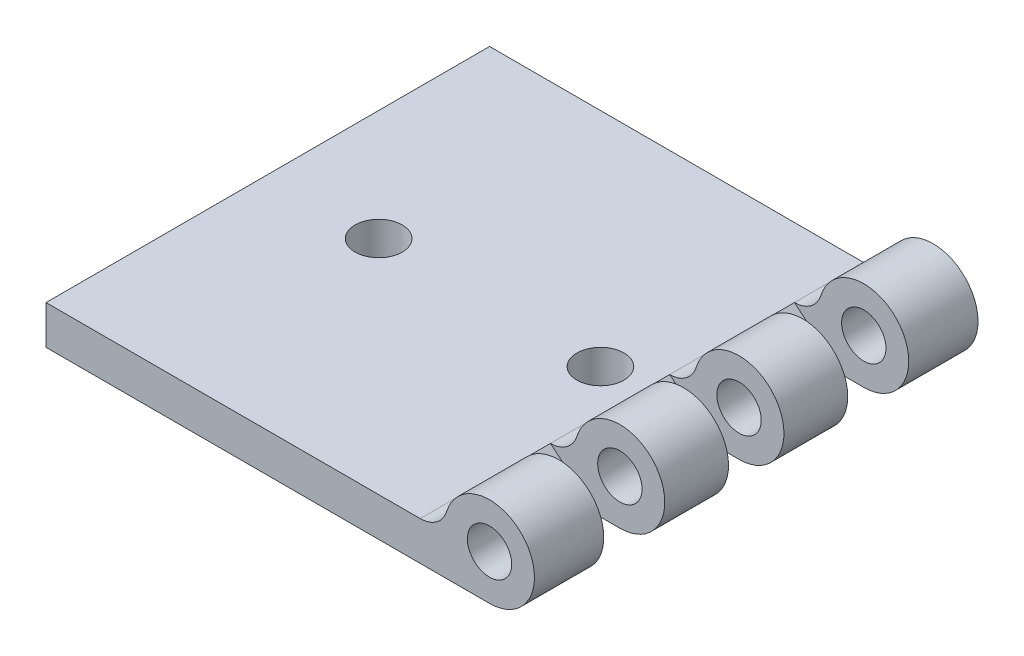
ISO-10303-21;
HEADER;
FILE_DESCRIPTION(('STEP AP214'),'2;1');
FILE_NAME('part.step','',(''),(''),'','','');
FILE_SCHEMA(('AUTOMOTIVE_DESIGN { 1 0 10303 214 1 1 1 1 }'));
ENDSEC;
DATA;
#1=APPLICATION_CONTEXT('core data for automotive mechanical design processes');
#2=APPLICATION_PROTOCOL_DEFINITION('international standard','automotive_design',2000,#1);
#3=PRODUCT_CONTEXT('',#1,'mechanical');
#4=PRODUCT('Part','Part','',(#3));
#5=PRODUCT_RELATED_PRODUCT_CATEGORY('part','',(#4));
#6=PRODUCT_DEFINITION_FORMATION('','',#4);
#7=PRODUCT_DEFINITION_CONTEXT('part definition',#1,'design');
#8=PRODUCT_DEFINITION('design','',#6,#7);
#9=PRODUCT_DEFINITION_SHAPE('','',#8);
#10=(LENGTH_UNIT() NAMED_UNIT(*) SI_UNIT(.MILLI.,.METRE.));
#11=(NAMED_UNIT(*) PLANE_ANGLE_UNIT() SI_UNIT($,.RADIAN.));
#12=(NAMED_UNIT(*) SI_UNIT($,.STERADIAN.) SOLID_ANGLE_UNIT());
#13=UNCERTAINTY_MEASURE_WITH_UNIT(LENGTH_MEASURE(1.E-05),#10,'distance_accuracy_value','');
#14=(GEOMETRIC_REPRESENTATION_CONTEXT(3) GLOBAL_UNCERTAINTY_ASSIGNED_CONTEXT((#13)) GLOBAL_UNIT_ASSIGNED_CONTEXT((#10,
#11,#12)) REPRESENTATION_CONTEXT('',''));
#15=CARTESIAN_POINT('',(0.,0.,0.));
#16=DIRECTION('',(0.,0.,1.));
#17=DIRECTION('',(1.,0.,0.));
#18=AXIS2_PLACEMENT_3D('',#15,#16,#17);
#19=CARTESIAN_POINT('',(-12.5059985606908,12.,80.));
#20=DIRECTION('',(0.,0.,-1.));
#21=DIRECTION('',(-1.,0.,0.));
#22=AXIS2_PLACEMENT_3D('',#19,#20,#21);
#23=CYLINDRICAL_SURFACE('',#22,5.);
#24=CARTESIAN_POINT('',(-12.5059985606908,12.,23.5));
#25=DIRECTION('',(0.,0.,-1.));
#26=DIRECTION('',(0.,1.,0.));
#27=AXIS2_PLACEMENT_3D('',#24,#25,#26);
#28=CIRCLE('',#27,5.);
#29=CARTESIAN_POINT('',(-12.5059985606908,6.99999999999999,23.5));
#30=VERTEX_POINT('',#29);
#31=CARTESIAN_POINT('',(-7.73271666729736,10.5114503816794,23.5));
#32=VERTEX_POINT('',#31);
#33=EDGE_CURVE('E158',#30,#32,#28,.F.);
#34=ORIENTED_EDGE('',*,*,#33,.F.);
#35=DIRECTION('',(0.,0.,-1.));
#36=VECTOR('',#35,1.);
#37=CARTESIAN_POINT('',(-12.5059985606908,6.99999999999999,80.));
#38=LINE('',#37,#36);
#39=CARTESIAN_POINT('',(-12.5059985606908,6.99999999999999,35.));
#40=VERTEX_POINT('',#39);
#41=EDGE_CURVE('E176',#40,#30,#38,.T.);
#42=ORIENTED_EDGE('',*,*,#41,.F.);
#43=CARTESIAN_POINT('',(-12.5059985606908,12.,35.));
#44=DIRECTION('',(0.,0.,1.));
#45=DIRECTION('',(1.,0.,0.));
#46=AXIS2_PLACEMENT_3D('',#43,#44,#45);
#47=CIRCLE('',#46,5.);
#48=CARTESIAN_POINT('',(-7.73271666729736,10.5114503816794,35.));
#49=VERTEX_POINT('',#48);
#50=EDGE_CURVE('E210',#49,#40,#47,.F.);
#51=ORIENTED_EDGE('',*,*,#50,.F.);
#52=DIRECTION('',(0.,0.,-1.));
#53=VECTOR('',#52,1.);
#54=CARTESIAN_POINT('',(-7.73271666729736,10.5114503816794,80.));
#55=LINE('',#54,#53);
#56=EDGE_CURVE('E179',#49,#32,#55,.T.);
#57=ORIENTED_EDGE('',*,*,#56,.T.);
#58=EDGE_LOOP('',(#34,#42,#51,#57));
#59=FACE_BOUND('',#58,.T.);
#60=ADVANCED_FACE('F34',(#59),#23,.F.);
#61=CARTESIAN_POINT('',(-12.5059985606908,12.,12.5));
#62=DIRECTION('',(0.,0.,1.));
#63=DIRECTION('',(0.,-1.,0.));
#64=AXIS2_PLACEMENT_3D('',#61,#62,#63);
#65=CIRCLE('',#64,5.);
#66=CARTESIAN_POINT('',(-7.73271666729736,10.5114503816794,12.5));
#67=VERTEX_POINT('',#66);
#68=CARTESIAN_POINT('',(-12.5059985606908,6.99999999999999,12.5));
#69=VERTEX_POINT('',#68);
#70=EDGE_CURVE('E222',#67,#69,#65,.F.);
#71=ORIENTED_EDGE('',*,*,#70,.F.);
#72=CARTESIAN_POINT('',(-7.73271666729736,10.5114503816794,0.));
#73=VERTEX_POINT('',#72);
#74=EDGE_CURVE('E276',#67,#73,#55,.T.);
#75=ORIENTED_EDGE('',*,*,#74,.T.);
#76=CARTESIAN_POINT('',(-12.5059985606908,12.,0.));
#77=DIRECTION('',(0.,0.,-1.));
#78=DIRECTION('',(-1.,0.,0.));
#79=AXIS2_PLACEMENT_3D('',#76,#77,#78);
#80=CIRCLE('',#79,5.);
#81=CARTESIAN_POINT('',(-12.5059985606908,6.99999999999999,0.));
#82=VERTEX_POINT('',#81);
#83=EDGE_CURVE('E261',#73,#82,#80,.T.);
#84=ORIENTED_EDGE('',*,*,#83,.T.);
#85=EDGE_CURVE('E185',#69,#82,#38,.T.);
#86=ORIENTED_EDGE('',*,*,#85,.F.);
#87=EDGE_LOOP('',(#71,#75,#84,#86));
#88=FACE_BOUND('',#87,.T.);
#89=ADVANCED_FACE('F369',(#88),#23,.F.);
#90=CARTESIAN_POINT('',(0.,0.,80.));
#91=DIRECTION('',(0.,1.,0.));
#92=DIRECTION('',(-1.,0.,0.));
#93=AXIS2_PLACEMENT_3D('',#90,#91,#92);
#94=PLANE('',#93);
#95=CARTESIAN_POINT('',(-20.,0.,40.));
#96=DIRECTION('',(0.,1.,0.));
#97=DIRECTION('',(-1.,0.,0.));
#98=AXIS2_PLACEMENT_3D('',#95,#96,#97);
#99=CIRCLE('',#98,4.25);
#100=CARTESIAN_POINT('',(-24.25,0.,40.));
#101=VERTEX_POINT('',#100);
#102=EDGE_CURVE('E432',#101,#101,#99,.T.);
#103=ORIENTED_EDGE('',*,*,#102,.T.);
#104=EDGE_LOOP('',(#103));
#105=FACE_BOUND('',#104,.T.);
#106=CARTESIAN_POINT('',(-60.,0.,40.));
#107=DIRECTION('',(0.,1.,0.));
#108=DIRECTION('',(-1.,0.,0.));
#109=AXIS2_PLACEMENT_3D('',#106,#107,#108);
#110=CIRCLE('',#109,4.25000000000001);
#111=CARTESIAN_POINT('',(-64.25,0.,40.));
#112=VERTEX_POINT('',#111);
#113=EDGE_CURVE('E170',#112,#112,#110,.T.);
#114=ORIENTED_EDGE('',*,*,#113,.T.);
#115=EDGE_LOOP('',(#114));
#116=FACE_BOUND('',#115,.T.);
#117=DIRECTION('',(-1.,0.,0.));
#118=VECTOR('',#117,1.);
#119=CARTESIAN_POINT('',(0.,0.,23.5));
#120=LINE('',#119,#118);
#121=CARTESIAN_POINT('',(0.,0.,23.5));
#122=VERTEX_POINT('',#121);
#123=CARTESIAN_POINT('',(-4.16372341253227,0.,23.5));
#124=VERTEX_POINT('',#123);
#125=EDGE_CURVE('E161',#122,#124,#120,.T.);
#126=ORIENTED_EDGE('',*,*,#125,.F.);
#127=DIRECTION('',(0.,0.,-1.));
#128=VECTOR('',#127,1.);
#129=CARTESIAN_POINT('',(0.,0.,80.));
#130=LINE('',#129,#128);
#131=CARTESIAN_POINT('',(0.,0.,35.));
#132=VERTEX_POINT('',#131);
#133=EDGE_CURVE('E319',#132,#122,#130,.T.);
#134=ORIENTED_EDGE('',*,*,#133,.F.);
#135=DIRECTION('',(1.,0.,0.));
#136=VECTOR('',#135,1.);
#137=CARTESIAN_POINT('',(0.,0.,35.));
#138=LINE('',#137,#136);
#139=CARTESIAN_POINT('',(-4.16372341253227,0.,35.));
#140=VERTEX_POINT('',#139);
#141=EDGE_CURVE('E233',#140,#132,#138,.T.);
#142=ORIENTED_EDGE('',*,*,#141,.F.);
#143=DIRECTION('',(0.,0.,-1.));
#144=VECTOR('',#143,1.);
#145=CARTESIAN_POINT('',(-4.16372341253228,0.,80.));
#146=LINE('',#145,#144);
#147=CARTESIAN_POINT('',(-4.16372341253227,0.,45.));
#148=VERTEX_POINT('',#147);
#149=EDGE_CURVE('E206',#148,#140,#146,.T.);
#150=ORIENTED_EDGE('',*,*,#149,.F.);
#151=DIRECTION('',(-1.,0.,0.));
#152=VECTOR('',#151,1.);
#153=CARTESIAN_POINT('',(0.,0.,45.));
#154=LINE('',#153,#152);
#155=CARTESIAN_POINT('',(0.,0.,45.));
#156=VERTEX_POINT('',#155);
#157=EDGE_CURVE('E237',#156,#148,#154,.T.);
#158=ORIENTED_EDGE('',*,*,#157,.F.);
#159=CARTESIAN_POINT('',(0.,0.,56.5));
#160=VERTEX_POINT('',#159);
#161=EDGE_CURVE('E296',#160,#156,#130,.T.);
#162=ORIENTED_EDGE('',*,*,#161,.F.);
#163=DIRECTION('',(1.,0.,0.));
#164=VECTOR('',#163,1.);
#165=CARTESIAN_POINT('',(0.,0.,56.5));
#166=LINE('',#165,#164);
#167=CARTESIAN_POINT('',(-4.16372341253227,0.,56.5));
#168=VERTEX_POINT('',#167);
#169=EDGE_CURVE('E249',#168,#160,#166,.T.);
#170=ORIENTED_EDGE('',*,*,#169,.F.);
#171=DIRECTION('',(0.,0.,-1.));
#172=VECTOR('',#171,1.);
#173=CARTESIAN_POINT('',(-4.16372341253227,0.,80.));
#174=LINE('',#173,#172);
#175=CARTESIAN_POINT('',(-4.16372341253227,0.,67.5));
#176=VERTEX_POINT('',#175);
#177=EDGE_CURVE('E11',#176,#168,#174,.T.);
#178=ORIENTED_EDGE('',*,*,#177,.F.);
#179=DIRECTION('',(-1.,0.,0.));
#180=VECTOR('',#179,1.);
#181=CARTESIAN_POINT('',(0.,0.,67.5));
#182=LINE('',#181,#180);
#183=CARTESIAN_POINT('',(0.,0.,67.5));
#184=VERTEX_POINT('',#183);
#185=EDGE_CURVE('E253',#184,#176,#182,.T.);
#186=ORIENTED_EDGE('',*,*,#185,.F.);
#187=CARTESIAN_POINT('',(0.,0.,80.));
#188=VERTEX_POINT('',#187);
#189=EDGE_CURVE('E293',#188,#184,#130,.T.);
#190=ORIENTED_EDGE('',*,*,#189,.F.);
#191=DIRECTION('',(1.,0.,0.));
#192=VECTOR('',#191,1.);
#193=CARTESIAN_POINT('',(0.,0.,80.));
#194=LINE('',#193,#192);
#195=CARTESIAN_POINT('',(-80.,0.,80.));
#196=VERTEX_POINT('',#195);
#197=EDGE_CURVE('E272',#196,#188,#194,.T.);
#198=ORIENTED_EDGE('',*,*,#197,.F.);
#199=DIRECTION('',(0.,0.,-1.));
#200=VECTOR('',#199,1.);
#201=CARTESIAN_POINT('',(-80.,0.,80.));
#202=LINE('',#201,#200);
#203=CARTESIAN_POINT('',(-80.,0.,0.));
#204=VERTEX_POINT('',#203);
#205=EDGE_CURVE('E295',#196,#204,#202,.T.);
#206=ORIENTED_EDGE('',*,*,#205,.T.);
#207=DIRECTION('',(1.,0.,0.));
#208=VECTOR('',#207,1.);
#209=CARTESIAN_POINT('',(0.,0.,0.));
#210=LINE('',#209,#208);
#211=CARTESIAN_POINT('',(0.,0.,0.));
#212=VERTEX_POINT('',#211);
#213=EDGE_CURVE('E283',#204,#212,#210,.T.);
#214=ORIENTED_EDGE('',*,*,#213,.T.);
#215=CARTESIAN_POINT('',(0.,0.,12.5));
#216=VERTEX_POINT('',#215);
#217=EDGE_CURVE('E291',#216,#212,#130,.T.);
#218=ORIENTED_EDGE('',*,*,#217,.F.);
#219=DIRECTION('',(1.,0.,0.));
#220=VECTOR('',#219,1.);
#221=CARTESIAN_POINT('',(0.,0.,12.5));
#222=LINE('',#221,#220);
#223=CARTESIAN_POINT('',(-4.16372341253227,0.,12.5));
#224=VERTEX_POINT('',#223);
#225=EDGE_CURVE('E216',#224,#216,#222,.T.);
#226=ORIENTED_EDGE('',*,*,#225,.F.);
#227=DIRECTION('',(0.,0.,-1.));
#228=VECTOR('',#227,1.);
#229=CARTESIAN_POINT('',(-4.16372341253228,0.,80.));
#230=LINE('',#229,#228);
#231=EDGE_CURVE('E163',#124,#224,#230,.T.);
#232=ORIENTED_EDGE('',*,*,#231,.F.);
#233=EDGE_LOOP('',(#126,#134,#142,#150,#158,#162,#170,#178,#186,#190,#198,#206,#214,#218,#226,#232));
#234=FACE_BOUND('',#233,.T.);
#235=ADVANCED_FACE('F315',(#105,#116,#234),#94,.F.);
#236=CARTESIAN_POINT('',(0.,8.1,80.));
#237=DIRECTION('',(0.,0.,-1.));
#238=DIRECTION('',(-1.,0.,0.));
#239=AXIS2_PLACEMENT_3D('',#236,#237,#238);
#240=CYLINDRICAL_SURFACE('',#239,8.1);
#241=CARTESIAN_POINT('',(0.,8.1,23.5));
#242=DIRECTION('',(0.,0.,-1.));
#243=DIRECTION('',(0.,1.,0.));
#244=AXIS2_PLACEMENT_3D('',#241,#242,#243);
#245=CIRCLE('',#244,8.1);
#246=EDGE_CURVE('E224',#32,#122,#245,.T.);
#247=ORIENTED_EDGE('',*,*,#246,.F.);
#248=ORIENTED_EDGE('',*,*,#56,.F.);
#249=CARTESIAN_POINT('',(0.,8.1,35.));
#250=DIRECTION('',(0.,0.,1.));
#251=DIRECTION('',(1.,0.,0.));
#252=AXIS2_PLACEMENT_3D('',#249,#250,#251);
#253=CIRCLE('',#252,8.1);
#254=EDGE_CURVE('E205',#132,#49,#253,.T.);
#255=ORIENTED_EDGE('',*,*,#254,.F.);
#256=ORIENTED_EDGE('',*,*,#133,.T.);
#257=EDGE_LOOP('',(#247,#248,#255,#256));
#258=FACE_BOUND('',#257,.T.);
#259=ADVANCED_FACE('F374',(#258),#240,.T.);
#260=CARTESIAN_POINT('',(0.,8.1,12.5));
#261=DIRECTION('',(0.,0.,1.));
#262=DIRECTION('',(0.,-1.,0.));
#263=AXIS2_PLACEMENT_3D('',#260,#261,#262);
#264=CIRCLE('',#263,8.1);
#265=EDGE_CURVE('E213',#216,#67,#264,.T.);
#266=ORIENTED_EDGE('',*,*,#265,.F.);
#267=ORIENTED_EDGE('',*,*,#217,.T.);
#268=CARTESIAN_POINT('',(0.,8.1,0.));
#269=DIRECTION('',(0.,0.,1.));
#270=DIRECTION('',(1.,0.,0.));
#271=AXIS2_PLACEMENT_3D('',#268,#269,#270);
#272=CIRCLE('',#271,8.1);
#273=EDGE_CURVE('E268',#212,#73,#272,.T.);
#274=ORIENTED_EDGE('',*,*,#273,.T.);
#275=ORIENTED_EDGE('',*,*,#74,.F.);
#276=EDGE_LOOP('',(#266,#267,#274,#275));
#277=FACE_BOUND('',#276,.T.);
#278=ADVANCED_FACE('F371',(#277),#240,.T.);
#279=CARTESIAN_POINT('',(0.,8.1,80.));
#280=DIRECTION('',(0.,0.,-1.));
#281=DIRECTION('',(-1.,0.,0.));
#282=AXIS2_PLACEMENT_3D('',#279,#280,#281);
#283=CYLINDRICAL_SURFACE('',#282,4.);
#284=CARTESIAN_POINT('',(0.,8.1,35.));
#285=DIRECTION('',(0.,0.,1.));
#286=DIRECTION('',(1.,0.,0.));
#287=AXIS2_PLACEMENT_3D('',#284,#285,#286);
#288=CIRCLE('',#287,4.);
#289=CARTESIAN_POINT('',(4.,8.1,35.));
#290=VERTEX_POINT('',#289);
#291=EDGE_CURVE('E202',#290,#290,#288,.T.);
#292=ORIENTED_EDGE('',*,*,#291,.T.);
#293=EDGE_LOOP('',(#292));
#294=FACE_BOUND('',#293,.T.);
#295=CARTESIAN_POINT('',(0.,8.1,23.5));
#296=DIRECTION('',(0.,0.,-1.));
#297=DIRECTION('',(0.,1.,0.));
#298=AXIS2_PLACEMENT_3D('',#295,#296,#297);
#299=CIRCLE('',#298,4.);
#300=CARTESIAN_POINT('',(0.,12.1,23.5));
#301=VERTEX_POINT('',#300);
#302=EDGE_CURVE('E38',#301,#301,#299,.T.);
#303=ORIENTED_EDGE('',*,*,#302,.T.);
#304=EDGE_LOOP('',(#303));
#305=FACE_BOUND('',#304,.T.);
#306=ADVANCED_FACE('F373',(#294,#305),#283,.F.);
#307=CARTESIAN_POINT('',(0.,8.1,0.));
#308=DIRECTION('',(0.,0.,1.));
#309=DIRECTION('',(1.,0.,0.));
#310=AXIS2_PLACEMENT_3D('',#307,#308,#309);
#311=CIRCLE('',#310,4.);
#312=CARTESIAN_POINT('',(4.,8.1,0.));
#313=VERTEX_POINT('',#312);
#314=EDGE_CURVE('E257',#313,#313,#311,.T.);
#315=ORIENTED_EDGE('',*,*,#314,.F.);
#316=EDGE_LOOP('',(#315));
#317=FACE_BOUND('',#316,.T.);
#318=CARTESIAN_POINT('',(0.,8.1,12.5));
#319=DIRECTION('',(0.,0.,1.));
#320=DIRECTION('',(0.,-1.,0.));
#321=AXIS2_PLACEMENT_3D('',#318,#319,#320);
#322=CIRCLE('',#321,4.);
#323=CARTESIAN_POINT('',(0.,4.1,12.5));
#324=VERTEX_POINT('',#323);
#325=EDGE_CURVE('E211',#324,#324,#322,.T.);
#326=ORIENTED_EDGE('',*,*,#325,.T.);
#327=EDGE_LOOP('',(#326));
#328=FACE_BOUND('',#327,.T.);
#329=ADVANCED_FACE('F380',(#317,#328),#283,.F.);
#330=CARTESIAN_POINT('',(-12.5059985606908,12.,45.));
#331=DIRECTION('',(0.,0.,-1.));
#332=DIRECTION('',(-1.,0.,0.));
#333=AXIS2_PLACEMENT_3D('',#330,#331,#332);
#334=CIRCLE('',#333,5.);
#335=CARTESIAN_POINT('',(-12.5059985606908,6.99999999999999,45.));
#336=VERTEX_POINT('',#335);
#337=CARTESIAN_POINT('',(-7.73271666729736,10.5114503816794,45.));
#338=VERTEX_POINT('',#337);
#339=EDGE_CURVE('E239',#336,#338,#334,.F.);
#340=ORIENTED_EDGE('',*,*,#339,.F.);
#341=CARTESIAN_POINT('',(-12.5059985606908,6.99999999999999,56.5));
#342=VERTEX_POINT('',#341);
#343=EDGE_CURVE('E184',#342,#336,#38,.T.);
#344=ORIENTED_EDGE('',*,*,#343,.F.);
#345=CARTESIAN_POINT('',(-12.5059985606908,12.,56.5));
#346=DIRECTION('',(0.,0.,1.));
#347=DIRECTION('',(1.,0.,0.));
#348=AXIS2_PLACEMENT_3D('',#345,#346,#347);
#349=CIRCLE('',#348,5.);
#350=CARTESIAN_POINT('',(-7.73271666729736,10.5114503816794,56.5));
#351=VERTEX_POINT('',#350);
#352=EDGE_CURVE('E200',#351,#342,#349,.F.);
#353=ORIENTED_EDGE('',*,*,#352,.F.);
#354=EDGE_CURVE('E292',#351,#338,#55,.T.);
#355=ORIENTED_EDGE('',*,*,#354,.T.);
#356=EDGE_LOOP('',(#340,#344,#353,#355));
#357=FACE_BOUND('',#356,.T.);
#358=ADVANCED_FACE('F344',(#357),#23,.F.);
#359=CARTESIAN_POINT('',(0.,8.1,45.));
#360=DIRECTION('',(0.,0.,-1.));
#361=DIRECTION('',(-1.,0.,0.));
#362=AXIS2_PLACEMENT_3D('',#359,#360,#361);
#363=CIRCLE('',#362,8.1);
#364=EDGE_CURVE('E209',#338,#156,#363,.T.);
#365=ORIENTED_EDGE('',*,*,#364,.F.);
#366=ORIENTED_EDGE('',*,*,#354,.F.);
#367=CARTESIAN_POINT('',(0.,8.1,56.5));
#368=DIRECTION('',(0.,0.,1.));
#369=DIRECTION('',(1.,0.,0.));
#370=AXIS2_PLACEMENT_3D('',#367,#368,#369);
#371=CIRCLE('',#370,8.1);
#372=EDGE_CURVE('E195',#160,#351,#371,.T.);
#373=ORIENTED_EDGE('',*,*,#372,.F.);
#374=ORIENTED_EDGE('',*,*,#161,.T.);
#375=EDGE_LOOP('',(#365,#366,#373,#374));
#376=FACE_BOUND('',#375,.T.);
#377=ADVANCED_FACE('F329',(#376),#240,.T.);
#378=CARTESIAN_POINT('',(0.,8.1,56.5));
#379=DIRECTION('',(0.,0.,1.));
#380=DIRECTION('',(1.,0.,0.));
#381=AXIS2_PLACEMENT_3D('',#378,#379,#380);
#382=CIRCLE('',#381,4.);
#383=CARTESIAN_POINT('',(4.,8.1,56.5));
#384=VERTEX_POINT('',#383);
#385=EDGE_CURVE('E192',#384,#384,#382,.T.);
#386=ORIENTED_EDGE('',*,*,#385,.T.);
#387=EDGE_LOOP('',(#386));
#388=FACE_BOUND('',#387,.T.);
#389=CARTESIAN_POINT('',(0.,8.1,45.));
#390=DIRECTION('',(0.,0.,-1.));
#391=DIRECTION('',(-1.,0.,0.));
#392=AXIS2_PLACEMENT_3D('',#389,#390,#391);
#393=CIRCLE('',#392,4.);
#394=CARTESIAN_POINT('',(-4.,8.1,45.));
#395=VERTEX_POINT('',#394);
#396=EDGE_CURVE('E207',#395,#395,#393,.T.);
#397=ORIENTED_EDGE('',*,*,#396,.T.);
#398=EDGE_LOOP('',(#397));
#399=FACE_BOUND('',#398,.T.);
#400=ADVANCED_FACE('F387',(#388,#399),#283,.F.);
#401=CARTESIAN_POINT('',(-12.5059985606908,12.,67.5));
#402=DIRECTION('',(0.,0.,-1.));
#403=DIRECTION('',(-1.,0.,0.));
#404=AXIS2_PLACEMENT_3D('',#401,#402,#403);
#405=CIRCLE('',#404,5.);
#406=CARTESIAN_POINT('',(-12.5059985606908,6.99999999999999,67.5));
#407=VERTEX_POINT('',#406);
#408=CARTESIAN_POINT('',(-7.73271666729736,10.5114503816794,67.5));
#409=VERTEX_POINT('',#408);
#410=EDGE_CURVE('E255',#407,#409,#405,.F.);
#411=ORIENTED_EDGE('',*,*,#410,.F.);
#412=CARTESIAN_POINT('',(-12.5059985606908,6.99999999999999,80.));
#413=VERTEX_POINT('',#412);
#414=EDGE_CURVE('E43',#413,#407,#38,.T.);
#415=ORIENTED_EDGE('',*,*,#414,.F.);
#416=CARTESIAN_POINT('',(-12.5059985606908,12.,80.));
#417=DIRECTION('',(0.,0.,-1.));
#418=DIRECTION('',(-1.,0.,0.));
#419=AXIS2_PLACEMENT_3D('',#416,#417,#418);
#420=CIRCLE('',#419,5.);
#421=CARTESIAN_POINT('',(-7.73271666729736,10.5114503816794,80.));
#422=VERTEX_POINT('',#421);
#423=EDGE_CURVE('E264',#422,#413,#420,.T.);
#424=ORIENTED_EDGE('',*,*,#423,.F.);
#425=EDGE_CURVE('E288',#422,#409,#55,.T.);
#426=ORIENTED_EDGE('',*,*,#425,.T.);
#427=EDGE_LOOP('',(#411,#415,#424,#426));
#428=FACE_BOUND('',#427,.T.);
#429=ADVANCED_FACE('F36',(#428),#23,.F.);
#430=CARTESIAN_POINT('',(0.,8.1,67.5));
#431=DIRECTION('',(0.,0.,-1.));
#432=DIRECTION('',(-1.,0.,0.));
#433=AXIS2_PLACEMENT_3D('',#430,#431,#432);
#434=CIRCLE('',#433,8.1);
#435=EDGE_CURVE('E199',#409,#184,#434,.T.);
#436=ORIENTED_EDGE('',*,*,#435,.F.);
#437=ORIENTED_EDGE('',*,*,#425,.F.);
#438=CARTESIAN_POINT('',(0.,8.1,80.));
#439=DIRECTION('',(0.,0.,1.));
#440=DIRECTION('',(1.,0.,0.));
#441=AXIS2_PLACEMENT_3D('',#438,#439,#440);
#442=CIRCLE('',#441,8.1);
#443=EDGE_CURVE('E274',#188,#422,#442,.T.);
#444=ORIENTED_EDGE('',*,*,#443,.F.);
#445=ORIENTED_EDGE('',*,*,#189,.T.);
#446=EDGE_LOOP('',(#436,#437,#444,#445));
#447=FACE_BOUND('',#446,.T.);
#448=ADVANCED_FACE('F361',(#447),#240,.T.);
#449=CARTESIAN_POINT('',(0.,8.1,80.));
#450=DIRECTION('',(0.,0.,1.));
#451=DIRECTION('',(1.,0.,0.));
#452=AXIS2_PLACEMENT_3D('',#449,#450,#451);
#453=CIRCLE('',#452,4.);
#454=CARTESIAN_POINT('',(4.,8.1,80.));
#455=VERTEX_POINT('',#454);
#456=EDGE_CURVE('E258',#455,#455,#453,.T.);
#457=ORIENTED_EDGE('',*,*,#456,.T.);
#458=EDGE_LOOP('',(#457));
#459=FACE_BOUND('',#458,.T.);
#460=CARTESIAN_POINT('',(0.,8.1,67.5));
#461=DIRECTION('',(0.,0.,-1.));
#462=DIRECTION('',(-1.,0.,0.));
#463=AXIS2_PLACEMENT_3D('',#460,#461,#462);
#464=CIRCLE('',#463,4.);
#465=CARTESIAN_POINT('',(-4.,8.1,67.5));
#466=VERTEX_POINT('',#465);
#467=EDGE_CURVE('E197',#466,#466,#464,.T.);
#468=ORIENTED_EDGE('',*,*,#467,.T.);
#469=EDGE_LOOP('',(#468));
#470=FACE_BOUND('',#469,.T.);
#471=ADVANCED_FACE('F383',(#459,#470),#283,.F.);
#472=CARTESIAN_POINT('',(-12.5059985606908,12.,80.));
#473=DIRECTION('',(0.,0.,-1.));
#474=DIRECTION('',(-1.,0.,0.));
#475=AXIS2_PLACEMENT_3D('',#472,#473,#474);
#476=PLANE('',#475);
#477=ORIENTED_EDGE('',*,*,#423,.T.);
#478=DIRECTION('',(-1.,0.,0.));
#479=VECTOR('',#478,1.);
#480=CARTESIAN_POINT('',(-80.,6.99999999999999,80.));
#481=LINE('',#480,#479);
#482=CARTESIAN_POINT('',(-80.,6.99999999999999,80.));
#483=VERTEX_POINT('',#482);
#484=EDGE_CURVE('E267',#413,#483,#481,.T.);
#485=ORIENTED_EDGE('',*,*,#484,.T.);
#486=DIRECTION('',(0.,-1.,0.));
#487=VECTOR('',#486,1.);
#488=CARTESIAN_POINT('',(-80.,0.,80.));
#489=LINE('',#488,#487);
#490=EDGE_CURVE('E270',#483,#196,#489,.T.);
#491=ORIENTED_EDGE('',*,*,#490,.T.);
#492=ORIENTED_EDGE('',*,*,#197,.T.);
#493=ORIENTED_EDGE('',*,*,#443,.T.);
#494=EDGE_LOOP('',(#477,#485,#491,#492,#493));
#495=FACE_BOUND('',#494,.T.);
#496=ORIENTED_EDGE('',*,*,#456,.F.);
#497=EDGE_LOOP('',(#496));
#498=FACE_BOUND('',#497,.T.);
#499=ADVANCED_FACE('F409',(#495,#498),#476,.F.);
#500=CARTESIAN_POINT('',(-12.5059985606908,12.,0.));
#501=DIRECTION('',(0.,0.,-1.));
#502=DIRECTION('',(-1.,0.,0.));
#503=AXIS2_PLACEMENT_3D('',#500,#501,#502);
#504=PLANE('',#503);
#505=ORIENTED_EDGE('',*,*,#83,.F.);
#506=ORIENTED_EDGE('',*,*,#273,.F.);
#507=ORIENTED_EDGE('',*,*,#213,.F.);
#508=DIRECTION('',(0.,-1.,0.));
#509=VECTOR('',#508,1.);
#510=CARTESIAN_POINT('',(-80.,0.,0.));
#511=LINE('',#510,#509);
#512=CARTESIAN_POINT('',(-80.,6.99999999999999,0.));
#513=VERTEX_POINT('',#512);
#514=EDGE_CURVE('E281',#513,#204,#511,.T.);
#515=ORIENTED_EDGE('',*,*,#514,.F.);
#516=DIRECTION('',(-1.,0.,0.));
#517=VECTOR('',#516,1.);
#518=CARTESIAN_POINT('',(-80.,6.99999999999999,0.));
#519=LINE('',#518,#517);
#520=EDGE_CURVE('E279',#82,#513,#519,.T.);
#521=ORIENTED_EDGE('',*,*,#520,.F.);
#522=EDGE_LOOP('',(#505,#506,#507,#515,#521));
#523=FACE_BOUND('',#522,.T.);
#524=ORIENTED_EDGE('',*,*,#314,.T.);
#525=EDGE_LOOP('',(#524));
#526=FACE_BOUND('',#525,.T.);
#527=ADVANCED_FACE('F311',(#523,#526),#504,.T.);
#528=CARTESIAN_POINT('',(-80.,6.99999999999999,80.));
#529=DIRECTION('',(0.,-1.,0.));
#530=DIRECTION('',(1.,0.,0.));
#531=AXIS2_PLACEMENT_3D('',#528,#529,#530);
#532=PLANE('',#531);
#533=CARTESIAN_POINT('',(-20.,6.99999999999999,40.));
#534=DIRECTION('',(0.,1.,0.));
#535=DIRECTION('',(-1.,0.,0.));
#536=AXIS2_PLACEMENT_3D('',#533,#534,#535);
#537=CIRCLE('',#536,4.25);
#538=CARTESIAN_POINT('',(-24.25,6.99999999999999,40.));
#539=VERTEX_POINT('',#538);
#540=EDGE_CURVE('E441',#539,#539,#537,.T.);
#541=ORIENTED_EDGE('',*,*,#540,.F.);
#542=EDGE_LOOP('',(#541));
#543=FACE_BOUND('',#542,.T.);
#544=CARTESIAN_POINT('',(-60.,6.99999999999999,40.));
#545=DIRECTION('',(0.,1.,0.));
#546=DIRECTION('',(-1.,0.,0.));
#547=AXIS2_PLACEMENT_3D('',#544,#545,#546);
#548=CIRCLE('',#547,4.25000000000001);
#549=CARTESIAN_POINT('',(-64.25,6.99999999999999,40.));
#550=VERTEX_POINT('',#549);
#551=EDGE_CURVE('E436',#550,#550,#548,.T.);
#552=ORIENTED_EDGE('',*,*,#551,.F.);
#553=EDGE_LOOP('',(#552));
#554=FACE_BOUND('',#553,.T.);
#555=ORIENTED_EDGE('',*,*,#520,.T.);
#556=DIRECTION('',(0.,0.,-1.));
#557=VECTOR('',#556,1.);
#558=CARTESIAN_POINT('',(-80.,6.99999999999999,80.));
#559=LINE('',#558,#557);
#560=EDGE_CURVE('E187',#483,#513,#559,.T.);
#561=ORIENTED_EDGE('',*,*,#560,.F.);
#562=ORIENTED_EDGE('',*,*,#484,.F.);
#563=ORIENTED_EDGE('',*,*,#414,.T.);
#564=DIRECTION('',(0.,0.,-1.));
#565=VECTOR('',#564,1.);
#566=CARTESIAN_POINT('',(-12.5059985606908,6.99999999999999,67.5));
#567=LINE('',#566,#565);
#568=EDGE_CURVE('E241',#407,#342,#567,.T.);
#569=ORIENTED_EDGE('',*,*,#568,.T.);
#570=ORIENTED_EDGE('',*,*,#343,.T.);
#571=DIRECTION('',(0.,0.,-1.));
#572=VECTOR('',#571,1.);
#573=CARTESIAN_POINT('',(-12.5059985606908,6.99999999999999,45.));
#574=LINE('',#573,#572);
#575=EDGE_CURVE('E180',#336,#40,#574,.T.);
#576=ORIENTED_EDGE('',*,*,#575,.T.);
#577=ORIENTED_EDGE('',*,*,#41,.T.);
#578=DIRECTION('',(0.,0.,-1.));
#579=VECTOR('',#578,1.);
#580=CARTESIAN_POINT('',(-12.5059985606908,6.99999999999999,23.5));
#581=LINE('',#580,#579);
#582=EDGE_CURVE('E166',#30,#69,#581,.T.);
#583=ORIENTED_EDGE('',*,*,#582,.T.);
#584=ORIENTED_EDGE('',*,*,#85,.T.);
#585=EDGE_LOOP('',(#555,#561,#562,#563,#569,#570,#576,#577,#583,#584));
#586=FACE_BOUND('',#585,.T.);
#587=ADVANCED_FACE('F182',(#543,#554,#586),#532,.F.);
#588=CARTESIAN_POINT('',(-80.,0.,80.));
#589=DIRECTION('',(1.,0.,0.));
#590=DIRECTION('',(0.,0.,-1.));
#591=AXIS2_PLACEMENT_3D('',#588,#589,#590);
#592=PLANE('',#591);
#593=ORIENTED_EDGE('',*,*,#514,.T.);
#594=ORIENTED_EDGE('',*,*,#205,.F.);
#595=ORIENTED_EDGE('',*,*,#490,.F.);
#596=ORIENTED_EDGE('',*,*,#560,.T.);
#597=EDGE_LOOP('',(#593,#594,#595,#596));
#598=FACE_BOUND('',#597,.T.);
#599=ADVANCED_FACE('F307',(#598),#592,.F.);
#600=CARTESIAN_POINT('',(3.03292490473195,-6.03870494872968,67.5));
#601=DIRECTION('',(0.642787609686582,0.766044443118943,0.));
#602=DIRECTION('',(-0.766044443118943,0.642787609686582,0.));
#603=AXIS2_PLACEMENT_3D('',#600,#601,#602);
#604=PLANE('',#603);
#605=ORIENTED_EDGE('',*,*,#177,.T.);
#606=DIRECTION('',(-0.766044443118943,0.642787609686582,0.));
#607=VECTOR('',#606,1.);
#608=CARTESIAN_POINT('',(3.03292490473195,-6.03870494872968,56.5));
#609=LINE('',#608,#607);
#610=EDGE_CURVE('E244',#168,#342,#609,.T.);
#611=ORIENTED_EDGE('',*,*,#610,.T.);
#612=ORIENTED_EDGE('',*,*,#568,.F.);
#613=DIRECTION('',(-0.766044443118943,0.642787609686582,0.));
#614=VECTOR('',#613,1.);
#615=CARTESIAN_POINT('',(3.03292490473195,-6.03870494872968,67.5));
#616=LINE('',#615,#614);
#617=EDGE_CURVE('E196',#176,#407,#616,.T.);
#618=ORIENTED_EDGE('',*,*,#617,.F.);
#619=EDGE_LOOP('',(#605,#611,#612,#618));
#620=FACE_BOUND('',#619,.T.);
#621=ADVANCED_FACE('F351',(#620),#604,.T.);
#622=CARTESIAN_POINT('',(3.03292490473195,-6.03870494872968,67.5));
#623=DIRECTION('',(0.,0.,-1.));
#624=DIRECTION('',(-1.,0.,0.));
#625=AXIS2_PLACEMENT_3D('',#622,#623,#624);
#626=PLANE('',#625);
#627=ORIENTED_EDGE('',*,*,#467,.F.);
#628=EDGE_LOOP('',(#627));
#629=FACE_BOUND('',#628,.T.);
#630=ORIENTED_EDGE('',*,*,#410,.T.);
#631=ORIENTED_EDGE('',*,*,#435,.T.);
#632=ORIENTED_EDGE('',*,*,#185,.T.);
#633=ORIENTED_EDGE('',*,*,#617,.T.);
#634=EDGE_LOOP('',(#630,#631,#632,#633));
#635=FACE_BOUND('',#634,.T.);
#636=ADVANCED_FACE('F358',(#629,#635),#626,.T.);
#637=CARTESIAN_POINT('',(3.03292490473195,-6.03870494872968,56.5));
#638=DIRECTION('',(0.,0.,1.));
#639=DIRECTION('',(1.,0.,0.));
#640=AXIS2_PLACEMENT_3D('',#637,#638,#639);
#641=PLANE('',#640);
#642=ORIENTED_EDGE('',*,*,#385,.F.);
#643=EDGE_LOOP('',(#642));
#644=FACE_BOUND('',#643,.T.);
#645=ORIENTED_EDGE('',*,*,#352,.T.);
#646=ORIENTED_EDGE('',*,*,#610,.F.);
#647=ORIENTED_EDGE('',*,*,#169,.T.);
#648=ORIENTED_EDGE('',*,*,#372,.T.);
#649=EDGE_LOOP('',(#645,#646,#647,#648));
#650=FACE_BOUND('',#649,.T.);
#651=ADVANCED_FACE('F365',(#644,#650),#641,.T.);
#652=CARTESIAN_POINT('',(3.03292490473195,-6.03870494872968,45.));
#653=DIRECTION('',(0.,0.,-1.));
#654=DIRECTION('',(-1.,0.,0.));
#655=AXIS2_PLACEMENT_3D('',#652,#653,#654);
#656=PLANE('',#655);
#657=ORIENTED_EDGE('',*,*,#396,.F.);
#658=EDGE_LOOP('',(#657));
#659=FACE_BOUND('',#658,.T.);
#660=ORIENTED_EDGE('',*,*,#339,.T.);
#661=ORIENTED_EDGE('',*,*,#364,.T.);
#662=ORIENTED_EDGE('',*,*,#157,.T.);
#663=DIRECTION('',(-0.766044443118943,0.642787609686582,0.));
#664=VECTOR('',#663,1.);
#665=CARTESIAN_POINT('',(3.03292490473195,-6.03870494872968,45.));
#666=LINE('',#665,#664);
#667=EDGE_CURVE('E229',#148,#336,#666,.T.);
#668=ORIENTED_EDGE('',*,*,#667,.T.);
#669=EDGE_LOOP('',(#660,#661,#662,#668));
#670=FACE_BOUND('',#669,.T.);
#671=ADVANCED_FACE('F339',(#659,#670),#656,.T.);
#672=CARTESIAN_POINT('',(3.03292490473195,-6.03870494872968,35.));
#673=DIRECTION('',(0.,0.,1.));
#674=DIRECTION('',(1.,0.,0.));
#675=AXIS2_PLACEMENT_3D('',#672,#673,#674);
#676=PLANE('',#675);
#677=ORIENTED_EDGE('',*,*,#291,.F.);
#678=EDGE_LOOP('',(#677));
#679=FACE_BOUND('',#678,.T.);
#680=ORIENTED_EDGE('',*,*,#50,.T.);
#681=DIRECTION('',(-0.766044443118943,0.642787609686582,0.));
#682=VECTOR('',#681,1.);
#683=CARTESIAN_POINT('',(3.03292490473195,-6.03870494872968,35.));
#684=LINE('',#683,#682);
#685=EDGE_CURVE('E59',#140,#40,#684,.T.);
#686=ORIENTED_EDGE('',*,*,#685,.F.);
#687=ORIENTED_EDGE('',*,*,#141,.T.);
#688=ORIENTED_EDGE('',*,*,#254,.T.);
#689=EDGE_LOOP('',(#680,#686,#687,#688));
#690=FACE_BOUND('',#689,.T.);
#691=ADVANCED_FACE('F464',(#679,#690),#676,.T.);
#692=CARTESIAN_POINT('',(3.03292490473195,-6.03870494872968,45.));
#693=DIRECTION('',(0.642787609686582,0.766044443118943,0.));
#694=DIRECTION('',(-0.766044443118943,0.642787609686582,0.));
#695=AXIS2_PLACEMENT_3D('',#692,#693,#694);
#696=PLANE('',#695);
#697=ORIENTED_EDGE('',*,*,#149,.T.);
#698=ORIENTED_EDGE('',*,*,#685,.T.);
#699=ORIENTED_EDGE('',*,*,#575,.F.);
#700=ORIENTED_EDGE('',*,*,#667,.F.);
#701=EDGE_LOOP('',(#697,#698,#699,#700));
#702=FACE_BOUND('',#701,.T.);
#703=ADVANCED_FACE('F340',(#702),#696,.T.);
#704=CARTESIAN_POINT('',(3.03292490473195,-6.03870494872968,23.5));
#705=DIRECTION('',(0.,0.,-1.));
#706=DIRECTION('',(0.,1.,0.));
#707=AXIS2_PLACEMENT_3D('',#704,#705,#706);
#708=PLANE('',#707);
#709=ORIENTED_EDGE('',*,*,#302,.F.);
#710=EDGE_LOOP('',(#709));
#711=FACE_BOUND('',#710,.T.);
#712=ORIENTED_EDGE('',*,*,#33,.T.);
#713=ORIENTED_EDGE('',*,*,#246,.T.);
#714=ORIENTED_EDGE('',*,*,#125,.T.);
#715=DIRECTION('',(-0.766044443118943,0.642787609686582,0.));
#716=VECTOR('',#715,1.);
#717=CARTESIAN_POINT('',(3.03292490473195,-6.03870494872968,23.5));
#718=LINE('',#717,#716);
#719=EDGE_CURVE('E155',#124,#30,#718,.T.);
#720=ORIENTED_EDGE('',*,*,#719,.T.);
#721=EDGE_LOOP('',(#712,#713,#714,#720));
#722=FACE_BOUND('',#721,.T.);
#723=ADVANCED_FACE('F156',(#711,#722),#708,.T.);
#724=CARTESIAN_POINT('',(3.03292490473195,-6.03870494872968,12.5));
#725=DIRECTION('',(0.,0.,1.));
#726=DIRECTION('',(0.,-1.,0.));
#727=AXIS2_PLACEMENT_3D('',#724,#725,#726);
#728=PLANE('',#727);
#729=ORIENTED_EDGE('',*,*,#325,.F.);
#730=EDGE_LOOP('',(#729));
#731=FACE_BOUND('',#730,.T.);
#732=ORIENTED_EDGE('',*,*,#70,.T.);
#733=DIRECTION('',(-0.766044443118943,0.642787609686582,0.));
#734=VECTOR('',#733,1.);
#735=CARTESIAN_POINT('',(3.03292490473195,-6.03870494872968,12.5));
#736=LINE('',#735,#734);
#737=EDGE_CURVE('E51',#224,#69,#736,.T.);
#738=ORIENTED_EDGE('',*,*,#737,.F.);
#739=ORIENTED_EDGE('',*,*,#225,.T.);
#740=ORIENTED_EDGE('',*,*,#265,.T.);
#741=EDGE_LOOP('',(#732,#738,#739,#740));
#742=FACE_BOUND('',#741,.T.);
#743=ADVANCED_FACE('F455',(#731,#742),#728,.T.);
#744=CARTESIAN_POINT('',(3.03292490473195,-6.03870494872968,23.5));
#745=DIRECTION('',(0.642787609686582,0.766044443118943,0.));
#746=DIRECTION('',(-0.766044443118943,0.642787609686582,0.));
#747=AXIS2_PLACEMENT_3D('',#744,#745,#746);
#748=PLANE('',#747);
#749=ORIENTED_EDGE('',*,*,#231,.T.);
#750=ORIENTED_EDGE('',*,*,#737,.T.);
#751=ORIENTED_EDGE('',*,*,#582,.F.);
#752=ORIENTED_EDGE('',*,*,#719,.F.);
#753=EDGE_LOOP('',(#749,#750,#751,#752));
#754=FACE_BOUND('',#753,.T.);
#755=ADVANCED_FACE('F167',(#754),#748,.T.);
#756=CARTESIAN_POINT('',(-60.,0.,40.));
#757=DIRECTION('',(0.,1.,0.));
#758=DIRECTION('',(-1.,0.,0.));
#759=AXIS2_PLACEMENT_3D('',#756,#757,#758);
#760=CYLINDRICAL_SURFACE('',#759,4.25000000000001);
#761=ORIENTED_EDGE('',*,*,#113,.F.);
#762=EDGE_LOOP('',(#761));
#763=FACE_BOUND('',#762,.T.);
#764=ORIENTED_EDGE('',*,*,#551,.T.);
#765=EDGE_LOOP('',(#764));
#766=FACE_BOUND('',#765,.T.);
#767=ADVANCED_FACE('F447',(#763,#766),#760,.F.);
#768=CARTESIAN_POINT('',(-20.,0.,40.));
#769=DIRECTION('',(0.,1.,0.));
#770=DIRECTION('',(-1.,0.,0.));
#771=AXIS2_PLACEMENT_3D('',#768,#769,#770);
#772=CYLINDRICAL_SURFACE('',#771,4.25);
#773=ORIENTED_EDGE('',*,*,#102,.F.);
#774=EDGE_LOOP('',(#773));
#775=FACE_BOUND('',#774,.T.);
#776=ORIENTED_EDGE('',*,*,#540,.T.);
#777=EDGE_LOOP('',(#776));
#778=FACE_BOUND('',#777,.T.);
#779=ADVANCED_FACE('F445',(#775,#778),#772,.F.);
#780=CLOSED_SHELL('',(#60,#89,#235,#259,#278,#306,#329,#358,#377,#400,#429,#448,#471,#499,#527,
#587,#599,#621,#636,#651,#671,#691,#703,#723,#743,#755,#767,#779));
#781=MANIFOLD_SOLID_BREP('B2',#780);
#782=ADVANCED_BREP_SHAPE_REPRESENTATION('',(#18,#781),#14);
#783=SHAPE_DEFINITION_REPRESENTATION(#9,#782);
ENDSEC;
END-ISO-10303-21;
